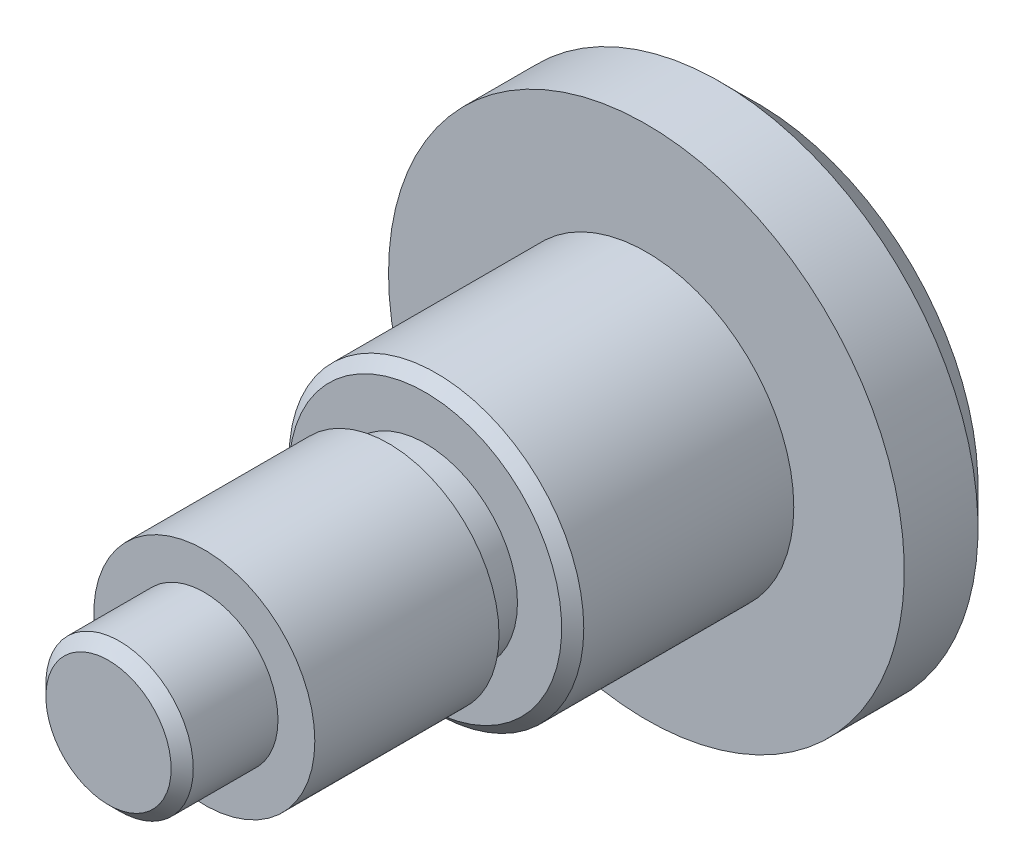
ISO-10303-21;
HEADER;
FILE_DESCRIPTION(('STEP AP214'),'2;1');
FILE_NAME('part.step','',(''),(''),'','','');
FILE_SCHEMA(('AUTOMOTIVE_DESIGN { 1 0 10303 214 1 1 1 1 }'));
ENDSEC;
DATA;
#1=APPLICATION_CONTEXT('core data for automotive mechanical design processes');
#2=APPLICATION_PROTOCOL_DEFINITION('international standard','automotive_design',2000,#1);
#3=PRODUCT_CONTEXT('',#1,'mechanical');
#4=PRODUCT('Part','Part','',(#3));
#5=PRODUCT_RELATED_PRODUCT_CATEGORY('part','',(#4));
#6=PRODUCT_DEFINITION_FORMATION('','',#4);
#7=PRODUCT_DEFINITION_CONTEXT('part definition',#1,'design');
#8=PRODUCT_DEFINITION('design','',#6,#7);
#9=PRODUCT_DEFINITION_SHAPE('','',#8);
#10=(LENGTH_UNIT() NAMED_UNIT(*) SI_UNIT(.MILLI.,.METRE.));
#11=(NAMED_UNIT(*) PLANE_ANGLE_UNIT() SI_UNIT($,.RADIAN.));
#12=(NAMED_UNIT(*) SI_UNIT($,.STERADIAN.) SOLID_ANGLE_UNIT());
#13=UNCERTAINTY_MEASURE_WITH_UNIT(LENGTH_MEASURE(1.E-05),#10,'distance_accuracy_value','');
#14=(GEOMETRIC_REPRESENTATION_CONTEXT(3) GLOBAL_UNCERTAINTY_ASSIGNED_CONTEXT((#13)) GLOBAL_UNIT_ASSIGNED_CONTEXT((#10,
#11,#12)) REPRESENTATION_CONTEXT('',''));
#15=CARTESIAN_POINT('',(0.,0.,0.));
#16=DIRECTION('',(0.,0.,1.));
#17=DIRECTION('',(1.,0.,0.));
#18=AXIS2_PLACEMENT_3D('',#15,#16,#17);
#19=CARTESIAN_POINT('',(-0.0121950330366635,-1.15463613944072,0.));
#20=DIRECTION('',(0.,0.,1.));
#21=DIRECTION('',(1.,0.,0.));
#22=AXIS2_PLACEMENT_3D('',#19,#20,#21);
#23=PLANE('',#22);
#24=CARTESIAN_POINT('',(0.,0.,0.));
#25=DIRECTION('',(0.,0.,-1.));
#26=DIRECTION('',(-1.,0.,0.));
#27=AXIS2_PLACEMENT_3D('',#24,#25,#26);
#28=CIRCLE('',#27,1.);
#29=CARTESIAN_POINT('',(-0.999944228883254,0.010561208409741,0.));
#30=VERTEX_POINT('',#29);
#31=CARTESIAN_POINT('',(-0.490825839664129,0.87125770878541,0.));
#32=VERTEX_POINT('',#31);
#33=EDGE_CURVE('E117',#30,#32,#28,.T.);
#34=ORIENTED_EDGE('',*,*,#33,.F.);
#35=DIRECTION('',(0.010561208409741,0.999944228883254,0.));
#36=VECTOR('',#35,1.);
#37=CARTESIAN_POINT('',(-1.00604174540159,-0.566756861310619,0.));
#38=LINE('',#37,#36);
#39=CARTESIAN_POINT('',(-0.993846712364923,0.587879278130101,0.));
#40=VERTEX_POINT('',#39);
#41=EDGE_CURVE('E143',#30,#40,#38,.T.);
#42=ORIENTED_EDGE('',*,*,#41,.T.);
#43=DIRECTION('',(0.87125770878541,0.490825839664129,0.));
#44=VECTOR('',#43,1.);
#45=CARTESIAN_POINT('',(-0.993846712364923,0.587879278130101,0.));
#46=LINE('',#45,#44);
#47=EDGE_CURVE('E139',#40,#32,#46,.T.);
#48=ORIENTED_EDGE('',*,*,#47,.T.);
#49=EDGE_LOOP('',(#34,#42,#48));
#50=FACE_BOUND('',#49,.T.);
#51=ADVANCED_FACE('F38',(#50),#23,.F.);
#52=CARTESIAN_POINT('',(0.509118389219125,0.860696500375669,0.));
#53=VERTEX_POINT('',#52);
#54=EDGE_CURVE('E119',#32,#53,#28,.T.);
#55=ORIENTED_EDGE('',*,*,#54,.F.);
#56=CARTESIAN_POINT('',(0.012195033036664,1.15463613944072,0.));
#57=VERTEX_POINT('',#56);
#58=EDGE_CURVE('E130',#32,#57,#46,.T.);
#59=ORIENTED_EDGE('',*,*,#58,.T.);
#60=DIRECTION('',(0.860696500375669,-0.509118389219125,0.));
#61=VECTOR('',#60,1.);
#62=CARTESIAN_POINT('',(0.012195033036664,1.15463613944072,0.));
#63=LINE('',#62,#61);
#64=EDGE_CURVE('E133',#57,#53,#63,.T.);
#65=ORIENTED_EDGE('',*,*,#64,.T.);
#66=EDGE_LOOP('',(#55,#59,#65));
#67=FACE_BOUND('',#66,.T.);
#68=ADVANCED_FACE('F129',(#67),#23,.F.);
#69=CARTESIAN_POINT('',(0.999944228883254,-0.0105612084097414,0.));
#70=VERTEX_POINT('',#69);
#71=EDGE_CURVE('E134',#53,#70,#28,.T.);
#72=ORIENTED_EDGE('',*,*,#71,.F.);
#73=CARTESIAN_POINT('',(1.00604174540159,0.566756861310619,0.));
#74=VERTEX_POINT('',#73);
#75=EDGE_CURVE('E145',#53,#74,#63,.T.);
#76=ORIENTED_EDGE('',*,*,#75,.T.);
#77=DIRECTION('',(-0.0105612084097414,-0.999944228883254,0.));
#78=VECTOR('',#77,1.);
#79=CARTESIAN_POINT('',(1.00604174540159,0.566756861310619,0.));
#80=LINE('',#79,#78);
#81=EDGE_CURVE('E151',#74,#70,#80,.T.);
#82=ORIENTED_EDGE('',*,*,#81,.T.);
#83=EDGE_LOOP('',(#72,#76,#82));
#84=FACE_BOUND('',#83,.T.);
#85=ADVANCED_FACE('F221',(#84),#23,.F.);
#86=CARTESIAN_POINT('',(0.490825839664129,-0.87125770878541,0.));
#87=VERTEX_POINT('',#86);
#88=EDGE_CURVE('E277',#70,#87,#28,.T.);
#89=ORIENTED_EDGE('',*,*,#88,.F.);
#90=CARTESIAN_POINT('',(0.993846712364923,-0.587879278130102,0.));
#91=VERTEX_POINT('',#90);
#92=EDGE_CURVE('E150',#70,#91,#80,.T.);
#93=ORIENTED_EDGE('',*,*,#92,.T.);
#94=DIRECTION('',(-0.87125770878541,-0.490825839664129,0.));
#95=VECTOR('',#94,1.);
#96=CARTESIAN_POINT('',(0.993846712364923,-0.587879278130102,0.));
#97=LINE('',#96,#95);
#98=EDGE_CURVE('E155',#91,#87,#97,.T.);
#99=ORIENTED_EDGE('',*,*,#98,.T.);
#100=EDGE_LOOP('',(#89,#93,#99));
#101=FACE_BOUND('',#100,.T.);
#102=ADVANCED_FACE('F234',(#101),#23,.F.);
#103=CARTESIAN_POINT('',(-0.509118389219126,-0.860696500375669,0.));
#104=VERTEX_POINT('',#103);
#105=EDGE_CURVE('E53',#87,#104,#28,.T.);
#106=ORIENTED_EDGE('',*,*,#105,.F.);
#107=CARTESIAN_POINT('',(-0.0121950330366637,-1.15463613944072,0.));
#108=VERTEX_POINT('',#107);
#109=EDGE_CURVE('E154',#87,#108,#97,.T.);
#110=ORIENTED_EDGE('',*,*,#109,.T.);
#111=DIRECTION('',(-0.860696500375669,0.509118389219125,0.));
#112=VECTOR('',#111,1.);
#113=CARTESIAN_POINT('',(-0.0121950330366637,-1.15463613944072,0.));
#114=LINE('',#113,#112);
#115=EDGE_CURVE('E243',#108,#104,#114,.T.);
#116=ORIENTED_EDGE('',*,*,#115,.T.);
#117=EDGE_LOOP('',(#106,#110,#116));
#118=FACE_BOUND('',#117,.T.);
#119=ADVANCED_FACE('F225',(#118),#23,.F.);
#120=EDGE_CURVE('E121',#104,#30,#28,.T.);
#121=ORIENTED_EDGE('',*,*,#120,.F.);
#122=CARTESIAN_POINT('',(-1.00604174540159,-0.566756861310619,0.));
#123=VERTEX_POINT('',#122);
#124=EDGE_CURVE('E238',#104,#123,#114,.T.);
#125=ORIENTED_EDGE('',*,*,#124,.T.);
#126=EDGE_CURVE('E141',#123,#30,#38,.T.);
#127=ORIENTED_EDGE('',*,*,#126,.T.);
#128=EDGE_LOOP('',(#121,#125,#127));
#129=FACE_BOUND('',#128,.T.);
#130=ADVANCED_FACE('F216',(#129),#23,.F.);
#131=CARTESIAN_POINT('',(0.,0.,6.));
#132=DIRECTION('',(0.,0.,1.));
#133=DIRECTION('',(1.,0.,0.));
#134=AXIS2_PLACEMENT_3D('',#131,#132,#133);
#135=PLANE('',#134);
#136=CARTESIAN_POINT('',(0.,0.,6.));
#137=DIRECTION('',(0.,0.,1.));
#138=DIRECTION('',(1.,0.,0.));
#139=AXIS2_PLACEMENT_3D('',#136,#137,#138);
#140=CIRCLE('',#139,1.5);
#141=CARTESIAN_POINT('',(1.5,0.,6.));
#142=VERTEX_POINT('',#141);
#143=EDGE_CURVE('E175',#142,#142,#140,.T.);
#144=ORIENTED_EDGE('',*,*,#143,.T.);
#145=EDGE_LOOP('',(#144));
#146=FACE_BOUND('',#145,.T.);
#147=CARTESIAN_POINT('',(0.,0.,6.));
#148=DIRECTION('',(0.,0.,1.));
#149=DIRECTION('',(1.,0.,0.));
#150=AXIS2_PLACEMENT_3D('',#147,#148,#149);
#151=CIRCLE('',#150,1.);
#152=CARTESIAN_POINT('',(1.,0.,6.));
#153=VERTEX_POINT('',#152);
#154=EDGE_CURVE('E161',#153,#153,#151,.T.);
#155=ORIENTED_EDGE('',*,*,#154,.F.);
#156=EDGE_LOOP('',(#155));
#157=FACE_BOUND('',#156,.T.);
#158=ADVANCED_FACE('F224',(#146,#157),#135,.T.);
#159=CARTESIAN_POINT('',(0.,0.,3.));
#160=DIRECTION('',(0.,0.,1.));
#161=DIRECTION('',(1.,0.,0.));
#162=AXIS2_PLACEMENT_3D('',#159,#160,#161);
#163=PLANE('',#162);
#164=CARTESIAN_POINT('',(0.,0.,3.));
#165=DIRECTION('',(0.,0.,1.));
#166=DIRECTION('',(1.,0.,0.));
#167=AXIS2_PLACEMENT_3D('',#164,#165,#166);
#168=CIRCLE('',#167,1.85);
#169=CARTESIAN_POINT('',(-1.85,0.,3.));
#170=VERTEX_POINT('',#169);
#171=EDGE_CURVE('E46',#170,#170,#168,.T.);
#172=ORIENTED_EDGE('',*,*,#171,.T.);
#173=EDGE_LOOP('',(#172));
#174=FACE_BOUND('',#173,.T.);
#175=CARTESIAN_POINT('',(0.,0.,3.));
#176=DIRECTION('',(0.,0.,1.));
#177=DIRECTION('',(1.,0.,0.));
#178=AXIS2_PLACEMENT_3D('',#175,#176,#177);
#179=CIRCLE('',#178,1.25);
#180=CARTESIAN_POINT('',(1.25,0.,3.));
#181=VERTEX_POINT('',#180);
#182=EDGE_CURVE('E178',#181,#181,#179,.T.);
#183=ORIENTED_EDGE('',*,*,#182,.F.);
#184=EDGE_LOOP('',(#183));
#185=FACE_BOUND('',#184,.T.);
#186=ADVANCED_FACE('F204',(#174,#185),#163,.T.);
#187=CARTESIAN_POINT('',(0.,0.,3.));
#188=DIRECTION('',(0.,0.,-1.));
#189=DIRECTION('',(-1.,0.,0.));
#190=AXIS2_PLACEMENT_3D('',#187,#188,#189);
#191=CYLINDRICAL_SURFACE('',#190,2.);
#192=CARTESIAN_POINT('',(0.,0.,2.85));
#193=DIRECTION('',(0.,0.,1.));
#194=DIRECTION('',(1.,0.,0.));
#195=AXIS2_PLACEMENT_3D('',#192,#193,#194);
#196=CIRCLE('',#195,2.);
#197=CARTESIAN_POINT('',(-2.,0.,2.85));
#198=VERTEX_POINT('',#197);
#199=EDGE_CURVE('E13',#198,#198,#196,.F.);
#200=ORIENTED_EDGE('',*,*,#199,.T.);
#201=EDGE_LOOP('',(#200));
#202=FACE_BOUND('',#201,.T.);
#203=CARTESIAN_POINT('',(0.,0.,0.));
#204=DIRECTION('',(0.,0.,-1.));
#205=DIRECTION('',(-1.,0.,0.));
#206=AXIS2_PLACEMENT_3D('',#203,#204,#205);
#207=CIRCLE('',#206,2.);
#208=CARTESIAN_POINT('',(-2.,0.,0.));
#209=VERTEX_POINT('',#208);
#210=EDGE_CURVE('E187',#209,#209,#207,.T.);
#211=ORIENTED_EDGE('',*,*,#210,.F.);
#212=EDGE_LOOP('',(#211));
#213=FACE_BOUND('',#212,.T.);
#214=ADVANCED_FACE('F40',(#202,#213),#191,.T.);
#215=CARTESIAN_POINT('',(0.,0.,0.));
#216=DIRECTION('',(0.,0.,-1.));
#217=DIRECTION('',(-1.,0.,0.));
#218=AXIS2_PLACEMENT_3D('',#215,#216,#217);
#219=PLANE('',#218);
#220=CARTESIAN_POINT('',(0.,0.,0.));
#221=DIRECTION('',(0.,0.,-1.));
#222=DIRECTION('',(-1.,0.,0.));
#223=AXIS2_PLACEMENT_3D('',#220,#221,#222);
#224=CIRCLE('',#223,3.5);
#225=CARTESIAN_POINT('',(-3.5,0.,0.));
#226=VERTEX_POINT('',#225);
#227=EDGE_CURVE('E184',#226,#226,#224,.T.);
#228=ORIENTED_EDGE('',*,*,#227,.F.);
#229=EDGE_LOOP('',(#228));
#230=FACE_BOUND('',#229,.T.);
#231=ORIENTED_EDGE('',*,*,#210,.T.);
#232=EDGE_LOOP('',(#231));
#233=FACE_BOUND('',#232,.T.);
#234=ADVANCED_FACE('F327',(#230,#233),#219,.F.);
#235=CARTESIAN_POINT('',(0.,0.,-1.5));
#236=DIRECTION('',(0.,0.,1.));
#237=DIRECTION('',(1.,0.,0.));
#238=AXIS2_PLACEMENT_3D('',#235,#236,#237);
#239=CYLINDRICAL_SURFACE('',#238,3.5);
#240=CARTESIAN_POINT('',(0.,0.,-0.999999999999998));
#241=DIRECTION('',(0.,0.,-1.));
#242=DIRECTION('',(-1.,0.,0.));
#243=AXIS2_PLACEMENT_3D('',#240,#241,#242);
#244=CIRCLE('',#243,3.5);
#245=CARTESIAN_POINT('',(-3.5,0.,-0.999999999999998));
#246=VERTEX_POINT('',#245);
#247=EDGE_CURVE('E193',#246,#246,#244,.F.);
#248=ORIENTED_EDGE('',*,*,#247,.T.);
#249=EDGE_LOOP('',(#248));
#250=FACE_BOUND('',#249,.T.);
#251=ORIENTED_EDGE('',*,*,#227,.T.);
#252=EDGE_LOOP('',(#251));
#253=FACE_BOUND('',#252,.T.);
#254=ADVANCED_FACE('F330',(#250,#253),#239,.T.);
#255=CARTESIAN_POINT('',(0.,0.,-1.5));
#256=DIRECTION('',(0.,0.,-1.));
#257=DIRECTION('',(-1.,0.,0.));
#258=AXIS2_PLACEMENT_3D('',#255,#256,#257);
#259=PLANE('',#258);
#260=DIRECTION('',(-0.860696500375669,0.509118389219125,0.));
#261=VECTOR('',#260,1.);
#262=CARTESIAN_POINT('',(-0.0121950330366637,-1.15463613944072,-1.5));
#263=LINE('',#262,#261);
#264=CARTESIAN_POINT('',(-0.0121950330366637,-1.15463613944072,-1.5));
#265=VERTEX_POINT('',#264);
#266=CARTESIAN_POINT('',(-1.00604174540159,-0.566756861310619,-1.5));
#267=VERTEX_POINT('',#266);
#268=EDGE_CURVE('E61',#265,#267,#263,.T.);
#269=ORIENTED_EDGE('',*,*,#268,.F.);
#270=DIRECTION('',(-0.87125770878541,-0.490825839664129,0.));
#271=VECTOR('',#270,1.);
#272=CARTESIAN_POINT('',(0.993846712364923,-0.587879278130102,-1.5));
#273=LINE('',#272,#271);
#274=CARTESIAN_POINT('',(0.993846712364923,-0.587879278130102,-1.5));
#275=VERTEX_POINT('',#274);
#276=EDGE_CURVE('E244',#275,#265,#273,.T.);
#277=ORIENTED_EDGE('',*,*,#276,.F.);
#278=DIRECTION('',(-0.0105612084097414,-0.999944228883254,0.));
#279=VECTOR('',#278,1.);
#280=CARTESIAN_POINT('',(1.00604174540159,0.566756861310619,-1.5));
#281=LINE('',#280,#279);
#282=CARTESIAN_POINT('',(1.00604174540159,0.566756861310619,-1.5));
#283=VERTEX_POINT('',#282);
#284=EDGE_CURVE('E250',#283,#275,#281,.T.);
#285=ORIENTED_EDGE('',*,*,#284,.F.);
#286=DIRECTION('',(0.860696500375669,-0.509118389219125,0.));
#287=VECTOR('',#286,1.);
#288=CARTESIAN_POINT('',(0.012195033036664,1.15463613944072,-1.5));
#289=LINE('',#288,#287);
#290=CARTESIAN_POINT('',(0.012195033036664,1.15463613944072,-1.5));
#291=VERTEX_POINT('',#290);
#292=EDGE_CURVE('E253',#291,#283,#289,.T.);
#293=ORIENTED_EDGE('',*,*,#292,.F.);
#294=DIRECTION('',(0.87125770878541,0.490825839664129,0.));
#295=VECTOR('',#294,1.);
#296=CARTESIAN_POINT('',(-0.993846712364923,0.587879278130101,-1.5));
#297=LINE('',#296,#295);
#298=CARTESIAN_POINT('',(-0.993846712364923,0.587879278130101,-1.5));
#299=VERTEX_POINT('',#298);
#300=EDGE_CURVE('E256',#299,#291,#297,.T.);
#301=ORIENTED_EDGE('',*,*,#300,.F.);
#302=DIRECTION('',(0.010561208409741,0.999944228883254,0.));
#303=VECTOR('',#302,1.);
#304=CARTESIAN_POINT('',(-1.00604174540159,-0.566756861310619,-1.5));
#305=LINE('',#304,#303);
#306=EDGE_CURVE('E258',#267,#299,#305,.T.);
#307=ORIENTED_EDGE('',*,*,#306,.F.);
#308=EDGE_LOOP('',(#269,#277,#285,#293,#301,#307));
#309=FACE_BOUND('',#308,.T.);
#310=CARTESIAN_POINT('',(0.,0.,-1.5));
#311=DIRECTION('',(0.,0.,-1.));
#312=DIRECTION('',(-1.,0.,0.));
#313=AXIS2_PLACEMENT_3D('',#310,#311,#312);
#314=CIRCLE('',#313,3.);
#315=CARTESIAN_POINT('',(-3.,0.,-1.5));
#316=VERTEX_POINT('',#315);
#317=EDGE_CURVE('E190',#316,#316,#314,.T.);
#318=ORIENTED_EDGE('',*,*,#317,.T.);
#319=EDGE_LOOP('',(#318));
#320=FACE_BOUND('',#319,.T.);
#321=ADVANCED_FACE('F266',(#309,#320),#259,.T.);
#322=CARTESIAN_POINT('',(0.,0.,-1.5));
#323=DIRECTION('',(0.,0.,1.));
#324=DIRECTION('',(1.,0.,0.));
#325=AXIS2_PLACEMENT_3D('',#322,#323,#324);
#326=CONICAL_SURFACE('',#325,3.,0.785398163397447);
#327=ORIENTED_EDGE('',*,*,#247,.F.);
#328=EDGE_LOOP('',(#327));
#329=FACE_BOUND('',#328,.T.);
#330=ORIENTED_EDGE('',*,*,#317,.F.);
#331=EDGE_LOOP('',(#330));
#332=FACE_BOUND('',#331,.T.);
#333=ADVANCED_FACE('F322',(#329,#332),#326,.T.);
#334=CARTESIAN_POINT('',(0.,0.,3.5));
#335=DIRECTION('',(0.,0.,-1.));
#336=DIRECTION('',(-1.,0.,0.));
#337=AXIS2_PLACEMENT_3D('',#334,#335,#336);
#338=CYLINDRICAL_SURFACE('',#337,1.25);
#339=CARTESIAN_POINT('',(0.,0.,3.5));
#340=DIRECTION('',(0.,0.,1.));
#341=DIRECTION('',(1.,0.,0.));
#342=AXIS2_PLACEMENT_3D('',#339,#340,#341);
#343=CIRCLE('',#342,1.25);
#344=CARTESIAN_POINT('',(1.25,0.,3.5));
#345=VERTEX_POINT('',#344);
#346=EDGE_CURVE('E181',#345,#345,#343,.T.);
#347=ORIENTED_EDGE('',*,*,#346,.F.);
#348=EDGE_LOOP('',(#347));
#349=FACE_BOUND('',#348,.T.);
#350=ORIENTED_EDGE('',*,*,#182,.T.);
#351=EDGE_LOOP('',(#350));
#352=FACE_BOUND('',#351,.T.);
#353=ADVANCED_FACE('F314',(#349,#352),#338,.T.);
#354=CARTESIAN_POINT('',(0.,0.,3.5));
#355=DIRECTION('',(0.,0.,1.));
#356=DIRECTION('',(1.,0.,0.));
#357=AXIS2_PLACEMENT_3D('',#354,#355,#356);
#358=PLANE('',#357);
#359=CARTESIAN_POINT('',(0.,0.,3.5));
#360=DIRECTION('',(0.,0.,1.));
#361=DIRECTION('',(1.,0.,0.));
#362=AXIS2_PLACEMENT_3D('',#359,#360,#361);
#363=CIRCLE('',#362,1.5);
#364=CARTESIAN_POINT('',(1.5,0.,3.5));
#365=VERTEX_POINT('',#364);
#366=EDGE_CURVE('E172',#365,#365,#363,.T.);
#367=ORIENTED_EDGE('',*,*,#366,.F.);
#368=EDGE_LOOP('',(#367));
#369=FACE_BOUND('',#368,.T.);
#370=ORIENTED_EDGE('',*,*,#346,.T.);
#371=EDGE_LOOP('',(#370));
#372=FACE_BOUND('',#371,.T.);
#373=ADVANCED_FACE('F312',(#369,#372),#358,.F.);
#374=CARTESIAN_POINT('',(0.,0.,6.));
#375=DIRECTION('',(0.,0.,-1.));
#376=DIRECTION('',(-1.,0.,0.));
#377=AXIS2_PLACEMENT_3D('',#374,#375,#376);
#378=CYLINDRICAL_SURFACE('',#377,1.5);
#379=ORIENTED_EDGE('',*,*,#143,.F.);
#380=EDGE_LOOP('',(#379));
#381=FACE_BOUND('',#380,.T.);
#382=ORIENTED_EDGE('',*,*,#366,.T.);
#383=EDGE_LOOP('',(#382));
#384=FACE_BOUND('',#383,.T.);
#385=ADVANCED_FACE('F310',(#381,#384),#378,.T.);
#386=CARTESIAN_POINT('',(0.,0.,7.3));
#387=DIRECTION('',(0.,0.,-1.));
#388=DIRECTION('',(-1.,0.,0.));
#389=AXIS2_PLACEMENT_3D('',#386,#387,#388);
#390=CYLINDRICAL_SURFACE('',#389,1.);
#391=CARTESIAN_POINT('',(0.,0.,7.15));
#392=DIRECTION('',(0.,0.,1.));
#393=DIRECTION('',(1.,0.,0.));
#394=AXIS2_PLACEMENT_3D('',#391,#392,#393);
#395=CIRCLE('',#394,1.);
#396=CARTESIAN_POINT('',(1.,0.,7.15));
#397=VERTEX_POINT('',#396);
#398=EDGE_CURVE('E199',#397,#397,#395,.F.);
#399=ORIENTED_EDGE('',*,*,#398,.T.);
#400=EDGE_LOOP('',(#399));
#401=FACE_BOUND('',#400,.T.);
#402=ORIENTED_EDGE('',*,*,#154,.T.);
#403=EDGE_LOOP('',(#402));
#404=FACE_BOUND('',#403,.T.);
#405=ADVANCED_FACE('F306',(#401,#404),#390,.T.);
#406=CARTESIAN_POINT('',(0.,0.,7.3));
#407=DIRECTION('',(0.,0.,1.));
#408=DIRECTION('',(1.,0.,0.));
#409=AXIS2_PLACEMENT_3D('',#406,#407,#408);
#410=PLANE('',#409);
#411=CARTESIAN_POINT('',(0.,0.,7.3));
#412=DIRECTION('',(0.,0.,1.));
#413=DIRECTION('',(1.,0.,0.));
#414=AXIS2_PLACEMENT_3D('',#411,#412,#413);
#415=CIRCLE('',#414,0.85);
#416=CARTESIAN_POINT('',(0.85,0.,7.3));
#417=VERTEX_POINT('',#416);
#418=EDGE_CURVE('E196',#417,#417,#415,.T.);
#419=ORIENTED_EDGE('',*,*,#418,.T.);
#420=EDGE_LOOP('',(#419));
#421=FACE_BOUND('',#420,.T.);
#422=ADVANCED_FACE('F302',(#421),#410,.T.);
#423=CARTESIAN_POINT('',(0.,0.,7.3));
#424=DIRECTION('',(0.,0.,-1.));
#425=DIRECTION('',(-1.,0.,0.));
#426=AXIS2_PLACEMENT_3D('',#423,#424,#425);
#427=CONICAL_SURFACE('',#426,0.85,0.785398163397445);
#428=ORIENTED_EDGE('',*,*,#398,.F.);
#429=EDGE_LOOP('',(#428));
#430=FACE_BOUND('',#429,.T.);
#431=ORIENTED_EDGE('',*,*,#418,.F.);
#432=EDGE_LOOP('',(#431));
#433=FACE_BOUND('',#432,.T.);
#434=ADVANCED_FACE('F291',(#430,#433),#427,.T.);
#435=CARTESIAN_POINT('',(-0.0121950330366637,-1.15463613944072,0.));
#436=DIRECTION('',(-0.509118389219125,-0.860696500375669,0.));
#437=DIRECTION('',(0.860696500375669,-0.509118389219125,0.));
#438=AXIS2_PLACEMENT_3D('',#435,#436,#437);
#439=PLANE('',#438);
#440=ORIENTED_EDGE('',*,*,#268,.T.);
#441=DIRECTION('',(0.,0.,-1.));
#442=VECTOR('',#441,1.);
#443=CARTESIAN_POINT('',(-1.00604174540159,-0.566756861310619,0.));
#444=LINE('',#443,#442);
#445=EDGE_CURVE('E158',#123,#267,#444,.T.);
#446=ORIENTED_EDGE('',*,*,#445,.F.);
#447=ORIENTED_EDGE('',*,*,#124,.F.);
#448=ORIENTED_EDGE('',*,*,#115,.F.);
#449=DIRECTION('',(0.,0.,-1.));
#450=VECTOR('',#449,1.);
#451=CARTESIAN_POINT('',(-0.0121950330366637,-1.15463613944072,0.));
#452=LINE('',#451,#450);
#453=EDGE_CURVE('E159',#108,#265,#452,.T.);
#454=ORIENTED_EDGE('',*,*,#453,.T.);
#455=EDGE_LOOP('',(#440,#446,#447,#448,#454));
#456=FACE_BOUND('',#455,.T.);
#457=ADVANCED_FACE('F242',(#456),#439,.F.);
#458=CARTESIAN_POINT('',(0.993846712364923,-0.587879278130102,0.));
#459=DIRECTION('',(0.490825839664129,-0.87125770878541,0.));
#460=DIRECTION('',(0.87125770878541,0.490825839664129,0.));
#461=AXIS2_PLACEMENT_3D('',#458,#459,#460);
#462=PLANE('',#461);
#463=ORIENTED_EDGE('',*,*,#276,.T.);
#464=ORIENTED_EDGE('',*,*,#453,.F.);
#465=ORIENTED_EDGE('',*,*,#109,.F.);
#466=ORIENTED_EDGE('',*,*,#98,.F.);
#467=DIRECTION('',(0.,0.,-1.));
#468=VECTOR('',#467,1.);
#469=CARTESIAN_POINT('',(0.993846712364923,-0.587879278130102,0.));
#470=LINE('',#469,#468);
#471=EDGE_CURVE('E162',#91,#275,#470,.T.);
#472=ORIENTED_EDGE('',*,*,#471,.T.);
#473=EDGE_LOOP('',(#463,#464,#465,#466,#472));
#474=FACE_BOUND('',#473,.T.);
#475=ADVANCED_FACE('F285',(#474),#462,.F.);
#476=CARTESIAN_POINT('',(1.00604174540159,0.566756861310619,0.));
#477=DIRECTION('',(0.999944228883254,-0.0105612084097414,0.));
#478=DIRECTION('',(0.0105612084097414,0.999944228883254,0.));
#479=AXIS2_PLACEMENT_3D('',#476,#477,#478);
#480=PLANE('',#479);
#481=ORIENTED_EDGE('',*,*,#284,.T.);
#482=ORIENTED_EDGE('',*,*,#471,.F.);
#483=ORIENTED_EDGE('',*,*,#92,.F.);
#484=ORIENTED_EDGE('',*,*,#81,.F.);
#485=DIRECTION('',(0.,0.,-1.));
#486=VECTOR('',#485,1.);
#487=CARTESIAN_POINT('',(1.00604174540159,0.566756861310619,0.));
#488=LINE('',#487,#486);
#489=EDGE_CURVE('E164',#74,#283,#488,.T.);
#490=ORIENTED_EDGE('',*,*,#489,.T.);
#491=EDGE_LOOP('',(#481,#482,#483,#484,#490));
#492=FACE_BOUND('',#491,.T.);
#493=ADVANCED_FACE('F283',(#492),#480,.F.);
#494=CARTESIAN_POINT('',(0.012195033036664,1.15463613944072,0.));
#495=DIRECTION('',(0.509118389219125,0.860696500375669,0.));
#496=DIRECTION('',(-0.860696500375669,0.509118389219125,0.));
#497=AXIS2_PLACEMENT_3D('',#494,#495,#496);
#498=PLANE('',#497);
#499=ORIENTED_EDGE('',*,*,#292,.T.);
#500=ORIENTED_EDGE('',*,*,#489,.F.);
#501=ORIENTED_EDGE('',*,*,#75,.F.);
#502=ORIENTED_EDGE('',*,*,#64,.F.);
#503=DIRECTION('',(0.,0.,-1.));
#504=VECTOR('',#503,1.);
#505=CARTESIAN_POINT('',(0.012195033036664,1.15463613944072,0.));
#506=LINE('',#505,#504);
#507=EDGE_CURVE('E140',#57,#291,#506,.T.);
#508=ORIENTED_EDGE('',*,*,#507,.T.);
#509=EDGE_LOOP('',(#499,#500,#501,#502,#508));
#510=FACE_BOUND('',#509,.T.);
#511=ADVANCED_FACE('F272',(#510),#498,.F.);
#512=CARTESIAN_POINT('',(-0.993846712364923,0.587879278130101,0.));
#513=DIRECTION('',(-0.490825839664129,0.87125770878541,0.));
#514=DIRECTION('',(-0.87125770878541,-0.490825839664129,0.));
#515=AXIS2_PLACEMENT_3D('',#512,#513,#514);
#516=PLANE('',#515);
#517=ORIENTED_EDGE('',*,*,#300,.T.);
#518=ORIENTED_EDGE('',*,*,#507,.F.);
#519=ORIENTED_EDGE('',*,*,#58,.F.);
#520=ORIENTED_EDGE('',*,*,#47,.F.);
#521=DIRECTION('',(0.,0.,-1.));
#522=VECTOR('',#521,1.);
#523=CARTESIAN_POINT('',(-0.993846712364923,0.587879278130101,0.));
#524=LINE('',#523,#522);
#525=EDGE_CURVE('E167',#40,#299,#524,.T.);
#526=ORIENTED_EDGE('',*,*,#525,.T.);
#527=EDGE_LOOP('',(#517,#518,#519,#520,#526));
#528=FACE_BOUND('',#527,.T.);
#529=ADVANCED_FACE('F138',(#528),#516,.F.);
#530=CARTESIAN_POINT('',(-1.00604174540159,-0.566756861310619,0.));
#531=DIRECTION('',(-0.999944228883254,0.010561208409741,0.));
#532=DIRECTION('',(-0.010561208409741,-0.999944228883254,0.));
#533=AXIS2_PLACEMENT_3D('',#530,#531,#532);
#534=PLANE('',#533);
#535=ORIENTED_EDGE('',*,*,#306,.T.);
#536=ORIENTED_EDGE('',*,*,#525,.F.);
#537=ORIENTED_EDGE('',*,*,#41,.F.);
#538=ORIENTED_EDGE('',*,*,#126,.F.);
#539=ORIENTED_EDGE('',*,*,#445,.T.);
#540=EDGE_LOOP('',(#535,#536,#537,#538,#539));
#541=FACE_BOUND('',#540,.T.);
#542=ADVANCED_FACE('F114',(#541),#534,.F.);
#543=CARTESIAN_POINT('',(0.,0.,0.));
#544=DIRECTION('',(0.,0.,-1.));
#545=DIRECTION('',(-1.,0.,0.));
#546=AXIS2_PLACEMENT_3D('',#543,#544,#545);
#547=CONICAL_SURFACE('',#546,1.,1.0471975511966);
#548=CARTESIAN_POINT('',(0.,0.,0.577350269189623));
#549=VERTEX_POINT('',#548);
#550=VERTEX_LOOP('',#549);
#551=FACE_BOUND('',#550,.T.);
#552=ORIENTED_EDGE('',*,*,#33,.T.);
#553=ORIENTED_EDGE('',*,*,#54,.T.);
#554=ORIENTED_EDGE('',*,*,#71,.T.);
#555=ORIENTED_EDGE('',*,*,#88,.T.);
#556=ORIENTED_EDGE('',*,*,#105,.T.);
#557=ORIENTED_EDGE('',*,*,#120,.T.);
#558=EDGE_LOOP('',(#552,#553,#554,#555,#556,#557));
#559=FACE_BOUND('',#558,.T.);
#560=ADVANCED_FACE('F111',(#551,#559),#547,.F.);
#561=CARTESIAN_POINT('',(0.,0.,3.));
#562=DIRECTION('',(0.,0.,-1.));
#563=DIRECTION('',(-1.,0.,0.));
#564=AXIS2_PLACEMENT_3D('',#561,#562,#563);
#565=CONICAL_SURFACE('',#564,1.85,0.785398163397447);
#566=CARTESIAN_POINT('',(-2.,0.,2.85));
#567=CARTESIAN_POINT('',(-1.9984375,0.,2.8515625));
#568=CARTESIAN_POINT('',(-1.996875,0.,2.853125));
#569=CARTESIAN_POINT('',(-1.99375,0.,2.85625));
#570=CARTESIAN_POINT('',(-1.9921875,0.,2.8578125));
#571=CARTESIAN_POINT('',(-1.9890625,0.,2.8609375));
#572=CARTESIAN_POINT('',(-1.9875,0.,2.8625));
#573=CARTESIAN_POINT('',(-1.984375,0.,2.865625));
#574=CARTESIAN_POINT('',(-1.9828125,0.,2.8671875));
#575=CARTESIAN_POINT('',(-1.9796875,0.,2.8703125));
#576=CARTESIAN_POINT('',(-1.978125,0.,2.871875));
#577=CARTESIAN_POINT('',(-1.975,0.,2.875));
#578=CARTESIAN_POINT('',(-1.9734375,0.,2.8765625));
#579=CARTESIAN_POINT('',(-1.9703125,0.,2.8796875));
#580=CARTESIAN_POINT('',(-1.96875,0.,2.88125));
#581=CARTESIAN_POINT('',(-1.965625,0.,2.884375));
#582=CARTESIAN_POINT('',(-1.9640625,0.,2.8859375));
#583=CARTESIAN_POINT('',(-1.9609375,0.,2.8890625));
#584=CARTESIAN_POINT('',(-1.959375,0.,2.890625));
#585=CARTESIAN_POINT('',(-1.95625,0.,2.89375));
#586=CARTESIAN_POINT('',(-1.9546875,0.,2.8953125));
#587=CARTESIAN_POINT('',(-1.9515625,0.,2.8984375));
#588=CARTESIAN_POINT('',(-1.95,0.,2.9));
#589=CARTESIAN_POINT('',(-1.946875,0.,2.903125));
#590=CARTESIAN_POINT('',(-1.9453125,0.,2.9046875));
#591=CARTESIAN_POINT('',(-1.9421875,0.,2.9078125));
#592=CARTESIAN_POINT('',(-1.940625,0.,2.909375));
#593=CARTESIAN_POINT('',(-1.9375,0.,2.9125));
#594=CARTESIAN_POINT('',(-1.9359375,0.,2.9140625));
#595=CARTESIAN_POINT('',(-1.9328125,0.,2.9171875));
#596=CARTESIAN_POINT('',(-1.93125,0.,2.91875));
#597=CARTESIAN_POINT('',(-1.928125,0.,2.921875));
#598=CARTESIAN_POINT('',(-1.9265625,0.,2.9234375));
#599=CARTESIAN_POINT('',(-1.9234375,0.,2.9265625));
#600=CARTESIAN_POINT('',(-1.921875,0.,2.928125));
#601=CARTESIAN_POINT('',(-1.91875,0.,2.93125));
#602=CARTESIAN_POINT('',(-1.9171875,0.,2.9328125));
#603=CARTESIAN_POINT('',(-1.9140625,0.,2.9359375));
#604=CARTESIAN_POINT('',(-1.9125,0.,2.9375));
#605=CARTESIAN_POINT('',(-1.909375,0.,2.940625));
#606=CARTESIAN_POINT('',(-1.9078125,0.,2.9421875));
#607=CARTESIAN_POINT('',(-1.9046875,0.,2.9453125));
#608=CARTESIAN_POINT('',(-1.903125,0.,2.946875));
#609=CARTESIAN_POINT('',(-1.9,0.,2.95));
#610=CARTESIAN_POINT('',(-1.8984375,0.,2.9515625));
#611=CARTESIAN_POINT('',(-1.8953125,0.,2.9546875));
#612=CARTESIAN_POINT('',(-1.89375,0.,2.95625));
#613=CARTESIAN_POINT('',(-1.890625,0.,2.959375));
#614=CARTESIAN_POINT('',(-1.8890625,0.,2.9609375));
#615=CARTESIAN_POINT('',(-1.8859375,0.,2.9640625));
#616=CARTESIAN_POINT('',(-1.884375,0.,2.965625));
#617=CARTESIAN_POINT('',(-1.88125,0.,2.96875));
#618=CARTESIAN_POINT('',(-1.8796875,0.,2.9703125));
#619=CARTESIAN_POINT('',(-1.8765625,0.,2.9734375));
#620=CARTESIAN_POINT('',(-1.875,0.,2.975));
#621=CARTESIAN_POINT('',(-1.871875,0.,2.978125));
#622=CARTESIAN_POINT('',(-1.8703125,0.,2.9796875));
#623=CARTESIAN_POINT('',(-1.8671875,0.,2.9828125));
#624=CARTESIAN_POINT('',(-1.865625,0.,2.984375));
#625=CARTESIAN_POINT('',(-1.8625,0.,2.9875));
#626=CARTESIAN_POINT('',(-1.8609375,0.,2.9890625));
#627=CARTESIAN_POINT('',(-1.8578125,0.,2.9921875));
#628=CARTESIAN_POINT('',(-1.85625,0.,2.99375));
#629=CARTESIAN_POINT('',(-1.853125,0.,2.996875));
#630=CARTESIAN_POINT('',(-1.8515625,0.,2.9984375));
#631=CARTESIAN_POINT('',(-1.85,0.,3.));
#632=B_SPLINE_CURVE_WITH_KNOTS('',3,(#566,#567,#568,#569,#570,#571,#572,#573,#574,#575,#576,
#577,#578,#579,#580,#581,#582,#583,#584,#585,#586,#587,#588,#589,#590,#591,#592,#593,#594,#595,
#596,#597,#598,#599,#600,#601,#602,#603,#604,#605,#606,#607,#608,#609,#610,#611,#612,#613,#614,
#615,#616,#617,#618,#619,#620,#621,#622,#623,#624,#625,#626,#627,#628,#629,#630,#631),
.UNSPECIFIED.,.F.,.F.,(4,2,2,2,2,2,2,2,2,2,2,2,2,2,2,2,2,2,2,2,2,2,2,2,2,2,2,2,2,2,2,2,4),(0.,
0.00662912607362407,0.0132582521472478,0.0198873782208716,0.0265165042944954,0.0331456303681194,
0.0397747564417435,0.0464038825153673,0.0530330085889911,0.0596621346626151,0.0662912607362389,
0.0729203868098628,0.0795495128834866,0.0861786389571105,0.0928077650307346,0.0994368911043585,
0.106066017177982,0.112695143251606,0.11932426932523,0.125953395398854,0.132582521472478,
0.139211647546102,0.145840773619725,0.15246989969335,0.159099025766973,0.165728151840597,
0.172357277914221,0.178986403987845,0.185615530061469,0.192244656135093,0.198873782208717,
0.205502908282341,0.212132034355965),.UNSPECIFIED.);
#633=EDGE_CURVE('BSEAM113',#198,#170,#632,.T.);
#634=ORIENTED_EDGE('',*,*,#199,.F.);
#635=ORIENTED_EDGE('',*,*,#171,.F.);
#636=ORIENTED_EDGE('',*,*,#633,.T.);
#637=ORIENTED_EDGE('',*,*,#633,.F.);
#638=EDGE_LOOP('',(#634,#636,#635,#637));
#639=FACE_BOUND('',#638,.T.);
#640=ADVANCED_FACE('F113',(#639),#565,.T.);
#641=CLOSED_SHELL('',(#51,#68,#85,#102,#119,#130,#158,#186,#214,#234,#254,#321,#333,#353,#373,
#385,#405,#422,#434,#457,#475,#493,#511,#529,#542,#560,#640));
#642=MANIFOLD_SOLID_BREP('B2',#641);
#643=ADVANCED_BREP_SHAPE_REPRESENTATION('',(#18,#642),#14);
#644=SHAPE_DEFINITION_REPRESENTATION(#9,#643);
ENDSEC;
END-ISO-10303-21;
